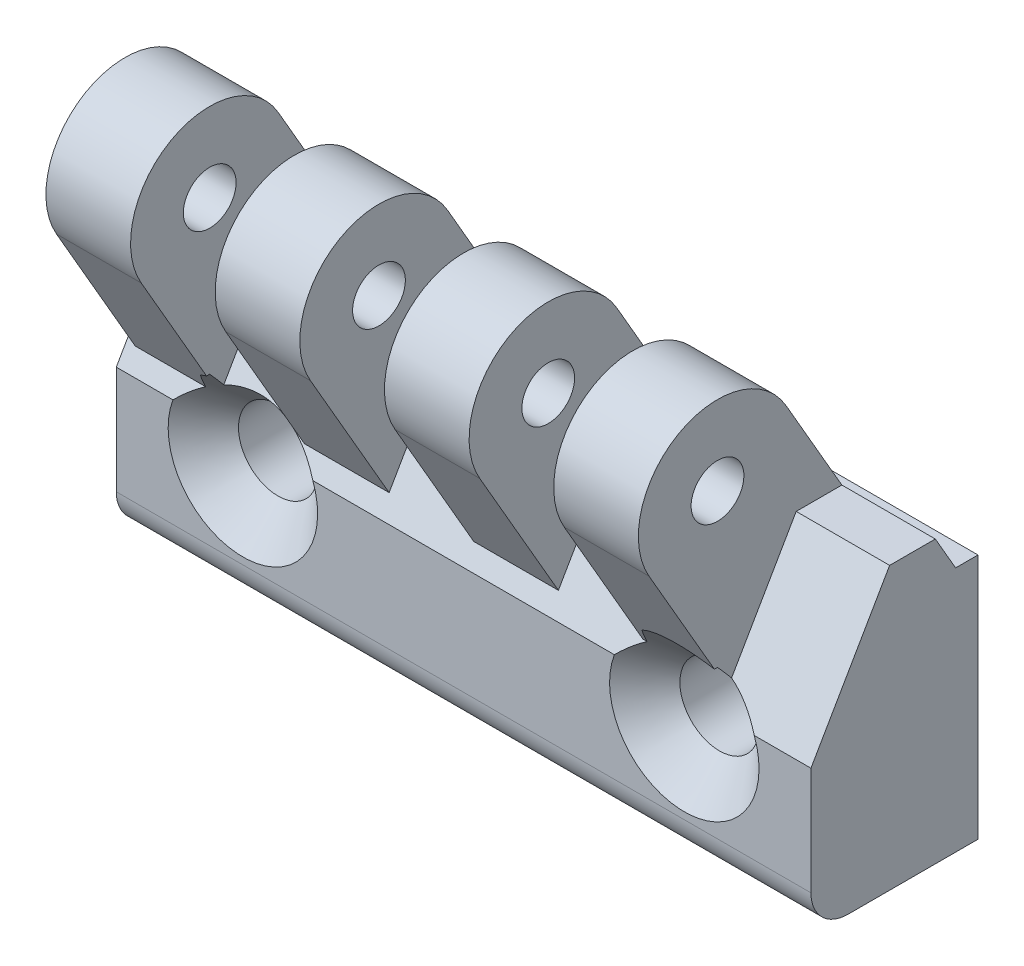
ISO-10303-21;
HEADER;
FILE_DESCRIPTION(('STEP AP214'),'2;1');
FILE_NAME('part.step','',(''),(''),'','','');
FILE_SCHEMA(('AUTOMOTIVE_DESIGN { 1 0 10303 214 1 1 1 1 }'));
ENDSEC;
DATA;
#1=APPLICATION_CONTEXT('core data for automotive mechanical design processes');
#2=APPLICATION_PROTOCOL_DEFINITION('international standard','automotive_design',2000,#1);
#3=PRODUCT_CONTEXT('',#1,'mechanical');
#4=PRODUCT('Part','Part','',(#3));
#5=PRODUCT_RELATED_PRODUCT_CATEGORY('part','',(#4));
#6=PRODUCT_DEFINITION_FORMATION('','',#4);
#7=PRODUCT_DEFINITION_CONTEXT('part definition',#1,'design');
#8=PRODUCT_DEFINITION('design','',#6,#7);
#9=PRODUCT_DEFINITION_SHAPE('','',#8);
#10=(LENGTH_UNIT() NAMED_UNIT(*) SI_UNIT(.MILLI.,.METRE.));
#11=(NAMED_UNIT(*) PLANE_ANGLE_UNIT() SI_UNIT($,.RADIAN.));
#12=(NAMED_UNIT(*) SI_UNIT($,.STERADIAN.) SOLID_ANGLE_UNIT());
#13=UNCERTAINTY_MEASURE_WITH_UNIT(LENGTH_MEASURE(1.E-05),#10,'distance_accuracy_value','');
#14=(GEOMETRIC_REPRESENTATION_CONTEXT(3) GLOBAL_UNCERTAINTY_ASSIGNED_CONTEXT((#13)) GLOBAL_UNIT_ASSIGNED_CONTEXT((#10,
#11,#12)) REPRESENTATION_CONTEXT('',''));
#15=CARTESIAN_POINT('',(0.,0.,0.));
#16=DIRECTION('',(0.,0.,1.));
#17=DIRECTION('',(1.,0.,0.));
#18=AXIS2_PLACEMENT_3D('',#15,#16,#17);
#19=CARTESIAN_POINT('',(32.3,9.25,5.0255354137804));
#20=DIRECTION('',(0.,-0.5,-0.866025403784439));
#21=DIRECTION('',(0.,0.866025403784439,-0.5));
#22=AXIS2_PLACEMENT_3D('',#19,#20,#21);
#23=PLANE('',#22);
#24=CARTESIAN_POINT('',(0.,-4.43060796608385,12.9240381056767));
#25=DIRECTION('',(0.,-0.5,-0.866025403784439));
#26=DIRECTION('',(0.,-0.866025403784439,0.5));
#27=AXIS2_PLACEMENT_3D('',#24,#25,#26);
#28=ELLIPSE('',#27,8.86121593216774,6.26582587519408);
#29=CARTESIAN_POINT('',(3.97649343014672,1.5,9.5));
#30=VERTEX_POINT('',#29);
#31=CARTESIAN_POINT('',(-1.8875,2.88696516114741,8.69923529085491));
#32=VERTEX_POINT('',#31);
#33=EDGE_CURVE('E29',#30,#32,#28,.F.);
#34=ORIENTED_EDGE('',*,*,#33,.F.);
#35=DIRECTION('',(-1.,0.,0.));
#36=VECTOR('',#35,1.);
#37=CARTESIAN_POINT('',(32.3,1.5,9.5));
#38=LINE('',#37,#36);
#39=CARTESIAN_POINT('',(21.1235065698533,1.5,9.5));
#40=VERTEX_POINT('',#39);
#41=EDGE_CURVE('E241',#40,#30,#38,.T.);
#42=ORIENTED_EDGE('',*,*,#41,.F.);
#43=CARTESIAN_POINT('',(25.1,-4.43060796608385,12.9240381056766));
#44=DIRECTION('',(0.,-0.5,-0.866025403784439));
#45=DIRECTION('',(0.,-0.866025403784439,0.5));
#46=AXIS2_PLACEMENT_3D('',#43,#44,#45);
#47=ELLIPSE('',#46,8.86121593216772,6.26582587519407);
#48=CARTESIAN_POINT('',(22.4095806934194,2.5,8.92264973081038));
#49=VERTEX_POINT('',#48);
#50=EDGE_CURVE('E952',#49,#40,#47,.F.);
#51=ORIENTED_EDGE('',*,*,#50,.F.);
#52=DIRECTION('',(1.,0.,0.));
#53=VECTOR('',#52,1.);
#54=CARTESIAN_POINT('',(32.3,2.5,8.92264973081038));
#55=LINE('',#54,#53);
#56=CARTESIAN_POINT('',(22.175,2.5,8.92264973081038));
#57=VERTEX_POINT('',#56);
#58=EDGE_CURVE('E387',#57,#49,#55,.T.);
#59=ORIENTED_EDGE('',*,*,#58,.F.);
#60=DIRECTION('',(0.,-0.866025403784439,0.5));
#61=VECTOR('',#60,1.);
#62=CARTESIAN_POINT('',(22.175,9.25,5.0255354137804));
#63=LINE('',#62,#61);
#64=CARTESIAN_POINT('',(22.175,9.25,5.0255354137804));
#65=VERTEX_POINT('',#64);
#66=EDGE_CURVE('E777',#65,#57,#63,.T.);
#67=ORIENTED_EDGE('',*,*,#66,.F.);
#68=DIRECTION('',(-1.,0.,0.));
#69=VECTOR('',#68,1.);
#70=CARTESIAN_POINT('',(32.3,9.25,5.0255354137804));
#71=LINE('',#70,#69);
#72=CARTESIAN_POINT('',(17.3625,9.25,5.0255354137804));
#73=VERTEX_POINT('',#72);
#74=EDGE_CURVE('E271',#65,#73,#71,.T.);
#75=ORIENTED_EDGE('',*,*,#74,.T.);
#76=DIRECTION('',(0.,-0.866025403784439,0.5));
#77=VECTOR('',#76,1.);
#78=CARTESIAN_POINT('',(17.3625,9.25,5.0255354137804));
#79=LINE('',#78,#77);
#80=CARTESIAN_POINT('',(17.3625,2.5,8.92264973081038));
#81=VERTEX_POINT('',#80);
#82=EDGE_CURVE('E373',#73,#81,#79,.T.);
#83=ORIENTED_EDGE('',*,*,#82,.T.);
#84=DIRECTION('',(1.,0.,0.));
#85=VECTOR('',#84,1.);
#86=CARTESIAN_POINT('',(32.3,2.5,8.92264973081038));
#87=LINE('',#86,#85);
#88=CARTESIAN_POINT('',(12.55,2.5,8.92264973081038));
#89=VERTEX_POINT('',#88);
#90=EDGE_CURVE('E365',#89,#81,#87,.T.);
#91=ORIENTED_EDGE('',*,*,#90,.F.);
#92=DIRECTION('',(0.,-0.866025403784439,0.5));
#93=VECTOR('',#92,1.);
#94=CARTESIAN_POINT('',(12.55,9.25,5.0255354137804));
#95=LINE('',#94,#93);
#96=CARTESIAN_POINT('',(12.55,9.25,5.0255354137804));
#97=VERTEX_POINT('',#96);
#98=EDGE_CURVE('E290',#97,#89,#95,.T.);
#99=ORIENTED_EDGE('',*,*,#98,.F.);
#100=CARTESIAN_POINT('',(7.7375,9.25,5.0255354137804));
#101=VERTEX_POINT('',#100);
#102=EDGE_CURVE('E276',#97,#101,#71,.T.);
#103=ORIENTED_EDGE('',*,*,#102,.T.);
#104=DIRECTION('',(0.,-0.866025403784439,0.5));
#105=VECTOR('',#104,1.);
#106=CARTESIAN_POINT('',(7.7375,9.25,5.0255354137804));
#107=LINE('',#106,#105);
#108=CARTESIAN_POINT('',(7.7375,2.5,8.92264973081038));
#109=VERTEX_POINT('',#108);
#110=EDGE_CURVE('E288',#101,#109,#107,.T.);
#111=ORIENTED_EDGE('',*,*,#110,.T.);
#112=DIRECTION('',(-1.,0.,0.));
#113=VECTOR('',#112,1.);
#114=CARTESIAN_POINT('',(32.3,2.5,8.92264973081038));
#115=LINE('',#114,#113);
#116=CARTESIAN_POINT('',(2.925,2.5,8.92264973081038));
#117=VERTEX_POINT('',#116);
#118=EDGE_CURVE('E376',#109,#117,#115,.T.);
#119=ORIENTED_EDGE('',*,*,#118,.T.);
#120=DIRECTION('',(0.,-0.866025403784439,0.5));
#121=VECTOR('',#120,1.);
#122=CARTESIAN_POINT('',(2.925,9.25,5.0255354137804));
#123=LINE('',#122,#121);
#124=CARTESIAN_POINT('',(2.925,9.25,5.0255354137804));
#125=VERTEX_POINT('',#124);
#126=EDGE_CURVE('E378',#125,#117,#123,.T.);
#127=ORIENTED_EDGE('',*,*,#126,.F.);
#128=CARTESIAN_POINT('',(-1.8875,9.25,5.0255354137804));
#129=VERTEX_POINT('',#128);
#130=EDGE_CURVE('E270',#125,#129,#71,.T.);
#131=ORIENTED_EDGE('',*,*,#130,.T.);
#132=DIRECTION('',(0.,-0.866025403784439,0.5));
#133=VECTOR('',#132,1.);
#134=CARTESIAN_POINT('',(-1.8875,9.25,5.0255354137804));
#135=LINE('',#134,#133);
#136=EDGE_CURVE('E810',#129,#32,#135,.T.);
#137=ORIENTED_EDGE('',*,*,#136,.T.);
#138=EDGE_LOOP('',(#34,#42,#51,#59,#67,#75,#83,#91,#99,#103,#111,#119,#127,#131,#137));
#139=FACE_BOUND('',#138,.T.);
#140=ADVANCED_FACE('F14',(#139),#23,.F.);
#141=CARTESIAN_POINT('',(-1.8875,12.5000000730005,9.50000004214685));
#142=DIRECTION('',(1.,0.,0.));
#143=DIRECTION('',(0.,1.,0.));
#144=AXIS2_PLACEMENT_3D('',#141,#142,#143);
#145=PLANE('',#144);
#146=CARTESIAN_POINT('',(-1.8875,12.5,9.5));
#147=DIRECTION('',(1.,0.,0.));
#148=DIRECTION('',(0.,1.,0.));
#149=AXIS2_PLACEMENT_3D('',#146,#147,#148);
#150=CIRCLE('',#149,1.5);
#151=CARTESIAN_POINT('',(-1.8875,14.,9.5));
#152=VERTEX_POINT('',#151);
#153=EDGE_CURVE('E787',#152,#152,#150,.T.);
#154=ORIENTED_EDGE('',*,*,#153,.F.);
#155=EDGE_LOOP('',(#154));
#156=FACE_BOUND('',#155,.T.);
#157=DIRECTION('',(0.,-0.866025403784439,-0.5));
#158=VECTOR('',#157,1.);
#159=CARTESIAN_POINT('',(-1.8875,10.25,13.39711431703));
#160=LINE('',#159,#158);
#161=CARTESIAN_POINT('',(-1.8875,10.25,13.39711431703));
#162=VERTEX_POINT('',#161);
#163=CARTESIAN_POINT('',(-1.8875,3.80786603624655,9.67774653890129));
#164=VERTEX_POINT('',#163);
#165=EDGE_CURVE('E801',#162,#164,#160,.T.);
#166=ORIENTED_EDGE('',*,*,#165,.T.);
#167=DIRECTION('',(0.,0.,-1.));
#168=VECTOR('',#167,1.);
#169=CARTESIAN_POINT('',(-1.8875,3.80786603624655,0.));
#170=LINE('',#169,#168);
#171=CARTESIAN_POINT('',(-1.8875,3.80786603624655,9.5));
#172=VERTEX_POINT('',#171);
#173=EDGE_CURVE('E9',#164,#172,#170,.T.);
#174=ORIENTED_EDGE('',*,*,#173,.T.);
#175=CARTESIAN_POINT('',(-1.8875,5.35278261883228,10.9258204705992));
#176=CARTESIAN_POINT('',(-1.8875,5.23920519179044,10.8187151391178));
#177=CARTESIAN_POINT('',(-1.8875,5.12544667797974,10.7118009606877));
#178=CARTESIAN_POINT('',(-1.8875,4.8974741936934,10.4984543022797));
#179=CARTESIAN_POINT('',(-1.8875,4.7832602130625,10.3920218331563));
#180=CARTESIAN_POINT('',(-1.8875,4.55423158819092,10.1796899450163));
#181=CARTESIAN_POINT('',(-1.8875,4.43941667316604,10.0737908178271));
#182=CARTESIAN_POINT('',(-1.8875,4.20911882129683,9.86272290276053));
#183=CARTESIAN_POINT('',(-1.8875,4.09363589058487,9.75755410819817));
#184=CARTESIAN_POINT('',(-1.8875,3.86246795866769,9.54870579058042));
#185=CARTESIAN_POINT('',(-1.8875,3.74678746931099,9.44502127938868));
#186=CARTESIAN_POINT('',(-1.8875,3.5143885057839,9.23882265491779));
#187=CARTESIAN_POINT('',(-1.8875,3.3976700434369,9.1363085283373));
#188=CARTESIAN_POINT('',(-1.8875,3.16290027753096,8.93282008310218));
#189=CARTESIAN_POINT('',(-1.8875,3.04484900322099,8.8318457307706));
#190=CARTESIAN_POINT('',(-1.8875,2.80700283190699,8.63197469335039));
#191=CARTESIAN_POINT('',(-1.8875,2.68720802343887,8.53307790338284));
#192=CARTESIAN_POINT('',(-1.8875,2.45986470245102,8.34993914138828));
#193=CARTESIAN_POINT('',(-1.8875,2.35258181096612,8.26536829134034));
#194=CARTESIAN_POINT('',(-1.8875,2.13567374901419,8.09936213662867));
#195=CARTESIAN_POINT('',(-1.8875,2.02604970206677,8.01792537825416));
#196=CARTESIAN_POINT('',(-1.8875,1.85908077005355,7.89902222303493));
#197=CARTESIAN_POINT('',(-1.8875,1.80292868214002,7.85988174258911));
#198=CARTESIAN_POINT('',(-1.8875,1.6896943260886,7.78298131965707));
#199=CARTESIAN_POINT('',(-1.8875,1.63261217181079,7.74522120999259));
#200=CARTESIAN_POINT('',(-1.8875,1.51727904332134,7.67132632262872));
#201=CARTESIAN_POINT('',(-1.8875,1.45902646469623,7.63519403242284));
#202=CARTESIAN_POINT('',(-1.8875,1.34123912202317,7.56503068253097));
#203=CARTESIAN_POINT('',(-1.8875,1.28170382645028,7.5310005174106));
#204=CARTESIAN_POINT('',(-1.8875,1.2214539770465,7.49824510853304));
#205=B_SPLINE_CURVE_WITH_KNOTS('',3,(#175,#176,#177,#178,#179,#180,#181,#182,#183,#184,#185,
#186,#187,#188,#189,#190,#191,#192,#193,#194,#195,#196,#197,#198,#199,#200,#201,#202,#203,#204),
.UNSPECIFIED.,.F.,.F.,(4,2,2,2,2,2,2,2,2,2,2,2,2,2,4),(0.,0.468340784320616,0.936692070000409,
1.40527657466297,1.87385678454,2.33988951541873,2.80591694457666,3.27193416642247,
3.7379278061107,4.14771742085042,4.55731461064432,4.76264044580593,4.96794133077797,
5.17354597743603,5.37923752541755),.UNSPECIFIED.);
#206=EDGE_CURVE('E22',#172,#32,#205,.T.);
#207=ORIENTED_EDGE('',*,*,#206,.T.);
#208=ORIENTED_EDGE('',*,*,#136,.F.);
#209=DIRECTION('',(0.,0.,1.));
#210=VECTOR('',#209,1.);
#211=CARTESIAN_POINT('',(-1.8875,9.25,2.42745920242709));
#212=LINE('',#211,#210);
#213=CARTESIAN_POINT('',(-1.8875,9.25,2.42745920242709));
#214=VERTEX_POINT('',#213);
#215=EDGE_CURVE('E813',#214,#129,#212,.T.);
#216=ORIENTED_EDGE('',*,*,#215,.F.);
#217=DIRECTION('',(0.,0.866025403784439,0.5));
#218=VECTOR('',#217,1.);
#219=CARTESIAN_POINT('',(-1.8875,6.77756813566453,1.));
#220=LINE('',#219,#218);
#221=CARTESIAN_POINT('',(-1.8875,14.75,5.60288568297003));
#222=VERTEX_POINT('',#221);
#223=EDGE_CURVE('E783',#214,#222,#220,.T.);
#224=ORIENTED_EDGE('',*,*,#223,.T.);
#225=CARTESIAN_POINT('',(-1.8875,12.5000000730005,9.50000004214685));
#226=DIRECTION('',(1.,0.,0.));
#227=DIRECTION('',(0.,1.,0.));
#228=AXIS2_PLACEMENT_3D('',#225,#226,#227);
#229=CIRCLE('',#228,4.5);
#230=EDGE_CURVE('E798',#222,#162,#229,.T.);
#231=ORIENTED_EDGE('',*,*,#230,.T.);
#232=EDGE_LOOP('',(#166,#174,#207,#208,#216,#224,#231));
#233=FACE_BOUND('',#232,.T.);
#234=ADVANCED_FACE('F423',(#156,#233),#145,.T.);
#235=CARTESIAN_POINT('',(29.0764934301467,1.5,9.5));
#236=VERTEX_POINT('',#235);
#237=CARTESIAN_POINT('',(26.9875,2.88696516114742,8.69923529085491));
#238=VERTEX_POINT('',#237);
#239=EDGE_CURVE('E37',#236,#238,#47,.F.);
#240=ORIENTED_EDGE('',*,*,#239,.F.);
#241=CARTESIAN_POINT('',(32.3,1.5,9.5));
#242=VERTEX_POINT('',#241);
#243=EDGE_CURVE('E261',#242,#236,#38,.T.);
#244=ORIENTED_EDGE('',*,*,#243,.F.);
#245=DIRECTION('',(0.,-0.866025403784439,0.5));
#246=VECTOR('',#245,1.);
#247=CARTESIAN_POINT('',(32.3,9.25,5.0255354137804));
#248=LINE('',#247,#246);
#249=CARTESIAN_POINT('',(32.3,9.25,5.0255354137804));
#250=VERTEX_POINT('',#249);
#251=EDGE_CURVE('E330',#250,#242,#248,.T.);
#252=ORIENTED_EDGE('',*,*,#251,.F.);
#253=CARTESIAN_POINT('',(26.9875,9.25,5.0255354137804));
#254=VERTEX_POINT('',#253);
#255=EDGE_CURVE('E277',#250,#254,#71,.T.);
#256=ORIENTED_EDGE('',*,*,#255,.T.);
#257=DIRECTION('',(0.,-0.866025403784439,0.5));
#258=VECTOR('',#257,1.);
#259=CARTESIAN_POINT('',(26.9875,9.25,5.0255354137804));
#260=LINE('',#259,#258);
#261=EDGE_CURVE('E780',#254,#238,#260,.T.);
#262=ORIENTED_EDGE('',*,*,#261,.T.);
#263=EDGE_LOOP('',(#240,#244,#252,#256,#262));
#264=FACE_BOUND('',#263,.T.);
#265=ADVANCED_FACE('F425',(#264),#23,.F.);
#266=CARTESIAN_POINT('',(26.9875,12.5000000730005,9.50000004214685));
#267=DIRECTION('',(1.,0.,0.));
#268=DIRECTION('',(0.,1.,0.));
#269=AXIS2_PLACEMENT_3D('',#266,#267,#268);
#270=PLANE('',#269);
#271=CARTESIAN_POINT('',(26.9875,12.5,9.5));
#272=DIRECTION('',(1.,0.,0.));
#273=DIRECTION('',(0.,1.,0.));
#274=AXIS2_PLACEMENT_3D('',#271,#272,#273);
#275=CIRCLE('',#274,1.5);
#276=CARTESIAN_POINT('',(26.9875,14.,9.5));
#277=VERTEX_POINT('',#276);
#278=EDGE_CURVE('E745',#277,#277,#275,.T.);
#279=ORIENTED_EDGE('',*,*,#278,.F.);
#280=EDGE_LOOP('',(#279));
#281=FACE_BOUND('',#280,.T.);
#282=DIRECTION('',(0.,-0.866025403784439,-0.5));
#283=VECTOR('',#282,1.);
#284=CARTESIAN_POINT('',(26.9875,10.25,13.39711431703));
#285=LINE('',#284,#283);
#286=CARTESIAN_POINT('',(26.9875,10.25,13.39711431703));
#287=VERTEX_POINT('',#286);
#288=CARTESIAN_POINT('',(26.9875,3.80786603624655,9.67774653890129));
#289=VERTEX_POINT('',#288);
#290=EDGE_CURVE('E749',#287,#289,#285,.T.);
#291=ORIENTED_EDGE('',*,*,#290,.T.);
#292=DIRECTION('',(0.,0.,-1.));
#293=VECTOR('',#292,1.);
#294=CARTESIAN_POINT('',(26.9875,3.80786603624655,0.));
#295=LINE('',#294,#293);
#296=CARTESIAN_POINT('',(26.9875,3.80786603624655,9.5));
#297=VERTEX_POINT('',#296);
#298=EDGE_CURVE('E398',#289,#297,#295,.T.);
#299=ORIENTED_EDGE('',*,*,#298,.T.);
#300=CARTESIAN_POINT('',(26.9875,5.35278261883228,10.9258204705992));
#301=CARTESIAN_POINT('',(26.9875,5.23920519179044,10.8187151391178));
#302=CARTESIAN_POINT('',(26.9875,5.12544667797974,10.7118009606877));
#303=CARTESIAN_POINT('',(26.9875,4.8974741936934,10.4984543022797));
#304=CARTESIAN_POINT('',(26.9875,4.7832602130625,10.3920218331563));
#305=CARTESIAN_POINT('',(26.9875,4.55423158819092,10.1796899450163));
#306=CARTESIAN_POINT('',(26.9875,4.43941667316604,10.0737908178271));
#307=CARTESIAN_POINT('',(26.9875,4.20911882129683,9.86272290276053));
#308=CARTESIAN_POINT('',(26.9875,4.09363589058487,9.75755410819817));
#309=CARTESIAN_POINT('',(26.9875,3.86246795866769,9.54870579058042));
#310=CARTESIAN_POINT('',(26.9875,3.74678746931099,9.44502127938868));
#311=CARTESIAN_POINT('',(26.9875,3.5143885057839,9.23882265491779));
#312=CARTESIAN_POINT('',(26.9875,3.3976700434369,9.1363085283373));
#313=CARTESIAN_POINT('',(26.9875,3.16290027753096,8.93282008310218));
#314=CARTESIAN_POINT('',(26.9875,3.04484900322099,8.8318457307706));
#315=CARTESIAN_POINT('',(26.9875,2.80700283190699,8.63197469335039));
#316=CARTESIAN_POINT('',(26.9875,2.68720802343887,8.53307790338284));
#317=CARTESIAN_POINT('',(26.9875,2.45986470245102,8.34993914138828));
#318=CARTESIAN_POINT('',(26.9875,2.35258181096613,8.26536829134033));
#319=CARTESIAN_POINT('',(26.9875,2.13567374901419,8.09936213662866));
#320=CARTESIAN_POINT('',(26.9875,2.02604970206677,8.01792537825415));
#321=CARTESIAN_POINT('',(26.9875,1.85908077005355,7.89902222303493));
#322=CARTESIAN_POINT('',(26.9875,1.80292868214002,7.85988174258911));
#323=CARTESIAN_POINT('',(26.9875,1.6896943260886,7.78298131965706));
#324=CARTESIAN_POINT('',(26.9875,1.63261217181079,7.74522120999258));
#325=CARTESIAN_POINT('',(26.9875,1.51727904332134,7.67132632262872));
#326=CARTESIAN_POINT('',(26.9875,1.45902646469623,7.63519403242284));
#327=CARTESIAN_POINT('',(26.9875,1.34123912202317,7.56503068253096));
#328=CARTESIAN_POINT('',(26.9875,1.28170382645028,7.53100051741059));
#329=CARTESIAN_POINT('',(26.9875,1.2214539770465,7.49824510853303));
#330=B_SPLINE_CURVE_WITH_KNOTS('',3,(#300,#301,#302,#303,#304,#305,#306,#307,#308,#309,#310,
#311,#312,#313,#314,#315,#316,#317,#318,#319,#320,#321,#322,#323,#324,#325,#326,#327,#328,#329),
.UNSPECIFIED.,.F.,.F.,(4,2,2,2,2,2,2,2,2,2,2,2,2,2,4),(0.,0.468340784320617,0.936692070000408,
1.40527657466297,1.87385678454,2.33988951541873,2.80591694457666,3.27193416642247,
3.73792780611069,4.14771742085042,4.55731461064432,4.76264044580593,4.96794133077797,
5.17354597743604,5.37923752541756),.UNSPECIFIED.);
#331=EDGE_CURVE('E390',#297,#238,#330,.T.);
#332=ORIENTED_EDGE('',*,*,#331,.T.);
#333=ORIENTED_EDGE('',*,*,#261,.F.);
#334=DIRECTION('',(0.,0.,1.));
#335=VECTOR('',#334,1.);
#336=CARTESIAN_POINT('',(26.9875,9.25,2.42745920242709));
#337=LINE('',#336,#335);
#338=CARTESIAN_POINT('',(26.9875,9.25,2.42745920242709));
#339=VERTEX_POINT('',#338);
#340=EDGE_CURVE('E385',#339,#254,#337,.T.);
#341=ORIENTED_EDGE('',*,*,#340,.F.);
#342=DIRECTION('',(0.,0.866025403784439,0.5));
#343=VECTOR('',#342,1.);
#344=CARTESIAN_POINT('',(26.9875,6.77756813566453,1.));
#345=LINE('',#344,#343);
#346=CARTESIAN_POINT('',(26.9875,14.75,5.60288568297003));
#347=VERTEX_POINT('',#346);
#348=EDGE_CURVE('E758',#339,#347,#345,.T.);
#349=ORIENTED_EDGE('',*,*,#348,.T.);
#350=CARTESIAN_POINT('',(26.9875,12.5000000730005,9.50000004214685));
#351=DIRECTION('',(1.,0.,0.));
#352=DIRECTION('',(0.,1.,0.));
#353=AXIS2_PLACEMENT_3D('',#350,#351,#352);
#354=CIRCLE('',#353,4.5);
#355=EDGE_CURVE('E751',#347,#287,#354,.T.);
#356=ORIENTED_EDGE('',*,*,#355,.T.);
#357=EDGE_LOOP('',(#291,#299,#332,#333,#341,#349,#356));
#358=FACE_BOUND('',#357,.T.);
#359=ADVANCED_FACE('F399',(#281,#358),#270,.T.);
#360=CARTESIAN_POINT('',(32.3,9.25,2.42745920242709));
#361=DIRECTION('',(0.,-1.,0.));
#362=DIRECTION('',(1.,0.,0.));
#363=AXIS2_PLACEMENT_3D('',#360,#361,#362);
#364=PLANE('',#363);
#365=DIRECTION('',(0.,0.,1.));
#366=VECTOR('',#365,1.);
#367=CARTESIAN_POINT('',(22.175,9.25,2.42745920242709));
#368=LINE('',#367,#366);
#369=CARTESIAN_POINT('',(22.175,9.25,2.42745920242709));
#370=VERTEX_POINT('',#369);
#371=EDGE_CURVE('E382',#370,#65,#368,.T.);
#372=ORIENTED_EDGE('',*,*,#371,.F.);
#373=DIRECTION('',(-1.,0.,0.));
#374=VECTOR('',#373,1.);
#375=CARTESIAN_POINT('',(32.3,9.25,2.42745920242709));
#376=LINE('',#375,#374);
#377=CARTESIAN_POINT('',(17.3625,9.25,2.42745920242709));
#378=VERTEX_POINT('',#377);
#379=EDGE_CURVE('E876',#370,#378,#376,.T.);
#380=ORIENTED_EDGE('',*,*,#379,.T.);
#381=DIRECTION('',(0.,0.,1.));
#382=VECTOR('',#381,1.);
#383=CARTESIAN_POINT('',(17.3625,9.25,2.42745920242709));
#384=LINE('',#383,#382);
#385=EDGE_CURVE('E306',#378,#73,#384,.T.);
#386=ORIENTED_EDGE('',*,*,#385,.T.);
#387=ORIENTED_EDGE('',*,*,#74,.F.);
#388=EDGE_LOOP('',(#372,#380,#386,#387));
#389=FACE_BOUND('',#388,.T.);
#390=ADVANCED_FACE('F445',(#389),#364,.F.);
#391=DIRECTION('',(0.,0.,1.));
#392=VECTOR('',#391,1.);
#393=CARTESIAN_POINT('',(-6.7,9.25,2.42745920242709));
#394=LINE('',#393,#392);
#395=CARTESIAN_POINT('',(-6.7,9.25,2.42745920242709));
#396=VERTEX_POINT('',#395);
#397=CARTESIAN_POINT('',(-6.7,9.25,5.0255354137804));
#398=VERTEX_POINT('',#397);
#399=EDGE_CURVE('E819',#396,#398,#394,.T.);
#400=ORIENTED_EDGE('',*,*,#399,.F.);
#401=CARTESIAN_POINT('',(-7.2,9.25,2.42745920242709));
#402=VERTEX_POINT('',#401);
#403=EDGE_CURVE('E283',#396,#402,#376,.T.);
#404=ORIENTED_EDGE('',*,*,#403,.T.);
#405=DIRECTION('',(0.,0.,1.));
#406=VECTOR('',#405,1.);
#407=CARTESIAN_POINT('',(-7.2,9.25,2.42745920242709));
#408=LINE('',#407,#406);
#409=CARTESIAN_POINT('',(-7.2,9.25,5.0255354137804));
#410=VERTEX_POINT('',#409);
#411=EDGE_CURVE('E345',#402,#410,#408,.T.);
#412=ORIENTED_EDGE('',*,*,#411,.T.);
#413=EDGE_CURVE('E267',#398,#410,#71,.T.);
#414=ORIENTED_EDGE('',*,*,#413,.F.);
#415=EDGE_LOOP('',(#400,#404,#412,#414));
#416=FACE_BOUND('',#415,.T.);
#417=ADVANCED_FACE('F438',(#416),#364,.F.);
#418=CARTESIAN_POINT('',(-2.6904193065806,2.5,8.92264973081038));
#419=VERTEX_POINT('',#418);
#420=CARTESIAN_POINT('',(-3.9764934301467,1.5,9.5));
#421=VERTEX_POINT('',#420);
#422=EDGE_CURVE('E246',#419,#421,#28,.F.);
#423=ORIENTED_EDGE('',*,*,#422,.F.);
#424=DIRECTION('',(-1.,0.,0.));
#425=VECTOR('',#424,1.);
#426=CARTESIAN_POINT('',(32.3,2.5,8.92264973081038));
#427=LINE('',#426,#425);
#428=CARTESIAN_POINT('',(-6.7,2.5,8.92264973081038));
#429=VERTEX_POINT('',#428);
#430=EDGE_CURVE('E380',#419,#429,#427,.T.);
#431=ORIENTED_EDGE('',*,*,#430,.T.);
#432=DIRECTION('',(0.,-0.866025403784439,0.5));
#433=VECTOR('',#432,1.);
#434=CARTESIAN_POINT('',(-6.7,9.25,5.0255354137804));
#435=LINE('',#434,#433);
#436=EDGE_CURVE('E816',#398,#429,#435,.T.);
#437=ORIENTED_EDGE('',*,*,#436,.F.);
#438=ORIENTED_EDGE('',*,*,#413,.T.);
#439=DIRECTION('',(0.,-0.866025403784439,0.5));
#440=VECTOR('',#439,1.);
#441=CARTESIAN_POINT('',(-7.2,9.25,5.0255354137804));
#442=LINE('',#441,#440);
#443=CARTESIAN_POINT('',(-7.2,1.5,9.5));
#444=VERTEX_POINT('',#443);
#445=EDGE_CURVE('E257',#410,#444,#442,.T.);
#446=ORIENTED_EDGE('',*,*,#445,.T.);
#447=EDGE_CURVE('E238',#421,#444,#38,.T.);
#448=ORIENTED_EDGE('',*,*,#447,.F.);
#449=EDGE_LOOP('',(#423,#431,#437,#438,#446,#448));
#450=FACE_BOUND('',#449,.T.);
#451=ADVANCED_FACE('F255',(#450),#23,.F.);
#452=CARTESIAN_POINT('',(2.925,9.25,2.42745920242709));
#453=VERTEX_POINT('',#452);
#454=EDGE_CURVE('E877',#453,#214,#376,.T.);
#455=ORIENTED_EDGE('',*,*,#454,.T.);
#456=ORIENTED_EDGE('',*,*,#215,.T.);
#457=ORIENTED_EDGE('',*,*,#130,.F.);
#458=DIRECTION('',(0.,0.,1.));
#459=VECTOR('',#458,1.);
#460=CARTESIAN_POINT('',(2.925,9.25,2.42745920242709));
#461=LINE('',#460,#459);
#462=EDGE_CURVE('E848',#453,#125,#461,.T.);
#463=ORIENTED_EDGE('',*,*,#462,.F.);
#464=EDGE_LOOP('',(#455,#456,#457,#463));
#465=FACE_BOUND('',#464,.T.);
#466=ADVANCED_FACE('F437',(#465),#364,.F.);
#467=CARTESIAN_POINT('',(12.55,9.25,2.42745920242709));
#468=VERTEX_POINT('',#467);
#469=CARTESIAN_POINT('',(7.7375,9.25,2.42745920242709));
#470=VERTEX_POINT('',#469);
#471=EDGE_CURVE('E875',#468,#470,#376,.T.);
#472=ORIENTED_EDGE('',*,*,#471,.T.);
#473=DIRECTION('',(0.,0.,1.));
#474=VECTOR('',#473,1.);
#475=CARTESIAN_POINT('',(7.7375,9.25,2.42745920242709));
#476=LINE('',#475,#474);
#477=EDGE_CURVE('E298',#470,#101,#476,.T.);
#478=ORIENTED_EDGE('',*,*,#477,.T.);
#479=ORIENTED_EDGE('',*,*,#102,.F.);
#480=DIRECTION('',(0.,0.,1.));
#481=VECTOR('',#480,1.);
#482=CARTESIAN_POINT('',(12.55,9.25,2.42745920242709));
#483=LINE('',#482,#481);
#484=EDGE_CURVE('E296',#468,#97,#483,.T.);
#485=ORIENTED_EDGE('',*,*,#484,.F.);
#486=EDGE_LOOP('',(#472,#478,#479,#485));
#487=FACE_BOUND('',#486,.T.);
#488=ADVANCED_FACE('F295',(#487),#364,.F.);
#489=CARTESIAN_POINT('',(32.3,-4.6388888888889,7.38888888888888));
#490=DIRECTION('',(-1.,0.,0.));
#491=DIRECTION('',(0.,-1.,0.));
#492=AXIS2_PLACEMENT_3D('',#489,#490,#491);
#493=CYLINDRICAL_SURFACE('',#492,2.11111111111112);
#494=CARTESIAN_POINT('',(-7.2,-4.6388888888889,7.38888888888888));
#495=DIRECTION('',(1.,0.,0.));
#496=DIRECTION('',(0.,1.,0.));
#497=AXIS2_PLACEMENT_3D('',#494,#495,#496);
#498=CIRCLE('',#497,2.11111111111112);
#499=CARTESIAN_POINT('',(-7.2,-4.6388888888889,9.5));
#500=VERTEX_POINT('',#499);
#501=CARTESIAN_POINT('',(-7.2,-6.75,7.38888888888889));
#502=VERTEX_POINT('',#501);
#503=EDGE_CURVE('E309',#500,#502,#498,.T.);
#504=ORIENTED_EDGE('',*,*,#503,.T.);
#505=DIRECTION('',(-1.,0.,0.));
#506=VECTOR('',#505,1.);
#507=CARTESIAN_POINT('',(32.3,-6.75,7.38888888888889));
#508=LINE('',#507,#506);
#509=CARTESIAN_POINT('',(32.3,-6.75,7.38888888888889));
#510=VERTEX_POINT('',#509);
#511=EDGE_CURVE('E361',#510,#502,#508,.T.);
#512=ORIENTED_EDGE('',*,*,#511,.F.);
#513=CARTESIAN_POINT('',(32.3,-4.6388888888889,7.38888888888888));
#514=DIRECTION('',(1.,0.,0.));
#515=DIRECTION('',(0.,1.,0.));
#516=AXIS2_PLACEMENT_3D('',#513,#514,#515);
#517=CIRCLE('',#516,2.11111111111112);
#518=CARTESIAN_POINT('',(32.3,-4.6388888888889,9.5));
#519=VERTEX_POINT('',#518);
#520=EDGE_CURVE('E316',#519,#510,#517,.T.);
#521=ORIENTED_EDGE('',*,*,#520,.F.);
#522=DIRECTION('',(-1.,0.,0.));
#523=VECTOR('',#522,1.);
#524=CARTESIAN_POINT('',(32.3,-4.6388888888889,9.5));
#525=LINE('',#524,#523);
#526=EDGE_CURVE('E259',#519,#500,#525,.T.);
#527=ORIENTED_EDGE('',*,*,#526,.T.);
#528=EDGE_LOOP('',(#504,#512,#521,#527));
#529=FACE_BOUND('',#528,.T.);
#530=ADVANCED_FACE('F16',(#529),#493,.T.);
#531=CARTESIAN_POINT('',(32.3,-6.75,7.38888888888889));
#532=DIRECTION('',(0.,1.,0.));
#533=DIRECTION('',(-1.,0.,0.));
#534=AXIS2_PLACEMENT_3D('',#531,#532,#533);
#535=PLANE('',#534);
#536=DIRECTION('',(0.,0.,-1.));
#537=VECTOR('',#536,1.);
#538=CARTESIAN_POINT('',(-7.2,-6.75,7.38888888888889));
#539=LINE('',#538,#537);
#540=CARTESIAN_POINT('',(-7.2,-6.75,0.));
#541=VERTEX_POINT('',#540);
#542=EDGE_CURVE('E335',#502,#541,#539,.T.);
#543=ORIENTED_EDGE('',*,*,#542,.T.);
#544=DIRECTION('',(-1.,0.,0.));
#545=VECTOR('',#544,1.);
#546=CARTESIAN_POINT('',(32.3,-6.75,0.));
#547=LINE('',#546,#545);
#548=CARTESIAN_POINT('',(32.3,-6.75,0.));
#549=VERTEX_POINT('',#548);
#550=EDGE_CURVE('E363',#549,#541,#547,.T.);
#551=ORIENTED_EDGE('',*,*,#550,.F.);
#552=DIRECTION('',(0.,0.,-1.));
#553=VECTOR('',#552,1.);
#554=CARTESIAN_POINT('',(32.3,-6.75,7.38888888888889));
#555=LINE('',#554,#553);
#556=EDGE_CURVE('E319',#510,#549,#555,.T.);
#557=ORIENTED_EDGE('',*,*,#556,.F.);
#558=ORIENTED_EDGE('',*,*,#511,.T.);
#559=EDGE_LOOP('',(#543,#551,#557,#558));
#560=FACE_BOUND('',#559,.T.);
#561=ADVANCED_FACE('F362',(#560),#535,.F.);
#562=CARTESIAN_POINT('',(32.3,-6.75,0.));
#563=DIRECTION('',(0.,0.,1.));
#564=DIRECTION('',(1.,0.,0.));
#565=AXIS2_PLACEMENT_3D('',#562,#563,#564);
#566=PLANE('',#565);
#567=CARTESIAN_POINT('',(0.,0.,0.));
#568=DIRECTION('',(0.,0.,-1.));
#569=DIRECTION('',(-1.,0.,0.));
#570=AXIS2_PLACEMENT_3D('',#567,#568,#569);
#571=CIRCLE('',#570,2.25);
#572=CARTESIAN_POINT('',(-2.25,0.,0.));
#573=VERTEX_POINT('',#572);
#574=EDGE_CURVE('E1004',#573,#573,#571,.T.);
#575=ORIENTED_EDGE('',*,*,#574,.F.);
#576=EDGE_LOOP('',(#575));
#577=FACE_BOUND('',#576,.T.);
#578=CARTESIAN_POINT('',(25.1,0.,0.));
#579=DIRECTION('',(0.,0.,-1.));
#580=DIRECTION('',(-1.,0.,0.));
#581=AXIS2_PLACEMENT_3D('',#578,#579,#580);
#582=CIRCLE('',#581,2.25);
#583=CARTESIAN_POINT('',(22.85,0.,0.));
#584=VERTEX_POINT('',#583);
#585=EDGE_CURVE('E941',#584,#584,#582,.T.);
#586=ORIENTED_EDGE('',*,*,#585,.F.);
#587=EDGE_LOOP('',(#586));
#588=FACE_BOUND('',#587,.T.);
#589=DIRECTION('',(0.,1.,0.));
#590=VECTOR('',#589,1.);
#591=CARTESIAN_POINT('',(-7.2,-6.75,0.));
#592=LINE('',#591,#590);
#593=CARTESIAN_POINT('',(-7.2,7.25,0.));
#594=VERTEX_POINT('',#593);
#595=EDGE_CURVE('E337',#541,#594,#592,.T.);
#596=ORIENTED_EDGE('',*,*,#595,.T.);
#597=DIRECTION('',(-1.,0.,0.));
#598=VECTOR('',#597,1.);
#599=CARTESIAN_POINT('',(32.3,7.25,0.));
#600=LINE('',#599,#598);
#601=CARTESIAN_POINT('',(32.3,7.25,0.));
#602=VERTEX_POINT('',#601);
#603=EDGE_CURVE('E367',#602,#594,#600,.T.);
#604=ORIENTED_EDGE('',*,*,#603,.F.);
#605=DIRECTION('',(0.,1.,0.));
#606=VECTOR('',#605,1.);
#607=CARTESIAN_POINT('',(32.3,-6.75,0.));
#608=LINE('',#607,#606);
#609=EDGE_CURVE('E322',#549,#602,#608,.T.);
#610=ORIENTED_EDGE('',*,*,#609,.F.);
#611=ORIENTED_EDGE('',*,*,#550,.T.);
#612=EDGE_LOOP('',(#596,#604,#610,#611));
#613=FACE_BOUND('',#612,.T.);
#614=ADVANCED_FACE('F464',(#577,#588,#613),#566,.F.);
#615=CARTESIAN_POINT('',(32.3,7.25,0.));
#616=DIRECTION('',(0.,-1.,0.));
#617=DIRECTION('',(1.,0.,0.));
#618=AXIS2_PLACEMENT_3D('',#615,#616,#617);
#619=PLANE('',#618);
#620=DIRECTION('',(0.,0.,1.));
#621=VECTOR('',#620,1.);
#622=CARTESIAN_POINT('',(-7.2,7.25,0.));
#623=LINE('',#622,#621);
#624=CARTESIAN_POINT('',(-7.2,7.25,1.27275866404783));
#625=VERTEX_POINT('',#624);
#626=EDGE_CURVE('E339',#594,#625,#623,.T.);
#627=ORIENTED_EDGE('',*,*,#626,.T.);
#628=DIRECTION('',(-1.,0.,0.));
#629=VECTOR('',#628,1.);
#630=CARTESIAN_POINT('',(32.3,7.25,1.27275866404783));
#631=LINE('',#630,#629);
#632=CARTESIAN_POINT('',(32.3,7.25,1.27275866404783));
#633=VERTEX_POINT('',#632);
#634=EDGE_CURVE('E881',#633,#625,#631,.T.);
#635=ORIENTED_EDGE('',*,*,#634,.F.);
#636=DIRECTION('',(0.,0.,1.));
#637=VECTOR('',#636,1.);
#638=CARTESIAN_POINT('',(32.3,7.25,0.));
#639=LINE('',#638,#637);
#640=EDGE_CURVE('E324',#602,#633,#639,.T.);
#641=ORIENTED_EDGE('',*,*,#640,.F.);
#642=ORIENTED_EDGE('',*,*,#603,.T.);
#643=EDGE_LOOP('',(#627,#635,#641,#642));
#644=FACE_BOUND('',#643,.T.);
#645=ADVANCED_FACE('F460',(#644),#619,.F.);
#646=CARTESIAN_POINT('',(32.3,7.25,1.27275866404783));
#647=DIRECTION('',(0.,-0.5,0.866025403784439));
#648=DIRECTION('',(0.,-0.866025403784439,-0.5));
#649=AXIS2_PLACEMENT_3D('',#646,#647,#648);
#650=PLANE('',#649);
#651=ORIENTED_EDGE('',*,*,#634,.T.);
#652=DIRECTION('',(0.,0.866025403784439,0.5));
#653=VECTOR('',#652,1.);
#654=CARTESIAN_POINT('',(-7.2,7.25,1.27275866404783));
#655=LINE('',#654,#653);
#656=EDGE_CURVE('E342',#625,#402,#655,.T.);
#657=ORIENTED_EDGE('',*,*,#656,.T.);
#658=ORIENTED_EDGE('',*,*,#403,.F.);
#659=DIRECTION('',(0.,0.866025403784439,0.5));
#660=VECTOR('',#659,1.);
#661=CARTESIAN_POINT('',(-6.7,6.77756813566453,1.));
#662=LINE('',#661,#660);
#663=CARTESIAN_POINT('',(-6.7,14.75,5.60288568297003));
#664=VERTEX_POINT('',#663);
#665=EDGE_CURVE('E784',#396,#664,#662,.T.);
#666=ORIENTED_EDGE('',*,*,#665,.T.);
#667=DIRECTION('',(1.,0.,0.));
#668=VECTOR('',#667,1.);
#669=CARTESIAN_POINT('',(-6.7,14.75,5.60288568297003));
#670=LINE('',#669,#668);
#671=EDGE_CURVE('E807',#664,#222,#670,.T.);
#672=ORIENTED_EDGE('',*,*,#671,.T.);
#673=ORIENTED_EDGE('',*,*,#223,.F.);
#674=ORIENTED_EDGE('',*,*,#454,.F.);
#675=DIRECTION('',(0.,0.866025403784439,0.5));
#676=VECTOR('',#675,1.);
#677=CARTESIAN_POINT('',(2.925,6.77756813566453,1.));
#678=LINE('',#677,#676);
#679=CARTESIAN_POINT('',(2.925,14.75,5.60288568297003));
#680=VERTEX_POINT('',#679);
#681=EDGE_CURVE('E822',#453,#680,#678,.T.);
#682=ORIENTED_EDGE('',*,*,#681,.T.);
#683=DIRECTION('',(1.,0.,0.));
#684=VECTOR('',#683,1.);
#685=CARTESIAN_POINT('',(2.925,14.75,5.60288568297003));
#686=LINE('',#685,#684);
#687=CARTESIAN_POINT('',(7.7375,14.75,5.60288568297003));
#688=VERTEX_POINT('',#687);
#689=EDGE_CURVE('E844',#680,#688,#686,.T.);
#690=ORIENTED_EDGE('',*,*,#689,.T.);
#691=DIRECTION('',(0.,0.866025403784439,0.5));
#692=VECTOR('',#691,1.);
#693=CARTESIAN_POINT('',(7.7375,6.77756813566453,1.));
#694=LINE('',#693,#692);
#695=EDGE_CURVE('E821',#470,#688,#694,.T.);
#696=ORIENTED_EDGE('',*,*,#695,.F.);
#697=ORIENTED_EDGE('',*,*,#471,.F.);
#698=DIRECTION('',(0.,0.866025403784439,0.5));
#699=VECTOR('',#698,1.);
#700=CARTESIAN_POINT('',(12.55,6.77756813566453,1.));
#701=LINE('',#700,#699);
#702=CARTESIAN_POINT('',(12.55,14.75,5.60288568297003));
#703=VERTEX_POINT('',#702);
#704=EDGE_CURVE('E305',#468,#703,#701,.T.);
#705=ORIENTED_EDGE('',*,*,#704,.T.);
#706=DIRECTION('',(-1.,0.,0.));
#707=VECTOR('',#706,1.);
#708=CARTESIAN_POINT('',(17.3625,14.75,5.60288568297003));
#709=LINE('',#708,#707);
#710=CARTESIAN_POINT('',(17.3625,14.75,5.60288568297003));
#711=VERTEX_POINT('',#710);
#712=EDGE_CURVE('E307',#711,#703,#709,.T.);
#713=ORIENTED_EDGE('',*,*,#712,.F.);
#714=DIRECTION('',(0.,0.866025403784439,0.5));
#715=VECTOR('',#714,1.);
#716=CARTESIAN_POINT('',(17.3625,6.77756813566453,1.));
#717=LINE('',#716,#715);
#718=EDGE_CURVE('E850',#378,#711,#717,.T.);
#719=ORIENTED_EDGE('',*,*,#718,.F.);
#720=ORIENTED_EDGE('',*,*,#379,.F.);
#721=DIRECTION('',(0.,0.866025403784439,0.5));
#722=VECTOR('',#721,1.);
#723=CARTESIAN_POINT('',(22.175,6.77756813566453,1.));
#724=LINE('',#723,#722);
#725=CARTESIAN_POINT('',(22.175,14.75,5.60288568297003));
#726=VERTEX_POINT('',#725);
#727=EDGE_CURVE('E762',#370,#726,#724,.T.);
#728=ORIENTED_EDGE('',*,*,#727,.T.);
#729=DIRECTION('',(-1.,0.,0.));
#730=VECTOR('',#729,1.);
#731=CARTESIAN_POINT('',(26.9875,14.75,5.60288568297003));
#732=LINE('',#731,#730);
#733=EDGE_CURVE('E774',#347,#726,#732,.T.);
#734=ORIENTED_EDGE('',*,*,#733,.F.);
#735=ORIENTED_EDGE('',*,*,#348,.F.);
#736=CARTESIAN_POINT('',(32.3,9.25,2.42745920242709));
#737=VERTEX_POINT('',#736);
#738=EDGE_CURVE('E878',#737,#339,#376,.T.);
#739=ORIENTED_EDGE('',*,*,#738,.F.);
#740=DIRECTION('',(0.,0.866025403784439,0.5));
#741=VECTOR('',#740,1.);
#742=CARTESIAN_POINT('',(32.3,7.25,1.27275866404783));
#743=LINE('',#742,#741);
#744=EDGE_CURVE('E326',#633,#737,#743,.T.);
#745=ORIENTED_EDGE('',*,*,#744,.F.);
#746=EDGE_LOOP('',(#651,#657,#658,#666,#672,#673,#674,#682,#690,#696,#697,#705,#713,#719,#720,
#728,#734,#735,#739,#745));
#747=FACE_BOUND('',#746,.T.);
#748=ADVANCED_FACE('F456',(#747),#650,.F.);
#749=ORIENTED_EDGE('',*,*,#738,.T.);
#750=ORIENTED_EDGE('',*,*,#340,.T.);
#751=ORIENTED_EDGE('',*,*,#255,.F.);
#752=DIRECTION('',(0.,0.,1.));
#753=VECTOR('',#752,1.);
#754=CARTESIAN_POINT('',(32.3,9.25,2.42745920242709));
#755=LINE('',#754,#753);
#756=EDGE_CURVE('E328',#737,#250,#755,.T.);
#757=ORIENTED_EDGE('',*,*,#756,.F.);
#758=EDGE_LOOP('',(#749,#750,#751,#757));
#759=FACE_BOUND('',#758,.T.);
#760=ADVANCED_FACE('F452',(#759),#364,.F.);
#761=CARTESIAN_POINT('',(32.3,1.5,9.5));
#762=DIRECTION('',(0.,0.,-1.));
#763=DIRECTION('',(-1.,0.,0.));
#764=AXIS2_PLACEMENT_3D('',#761,#762,#763);
#765=PLANE('',#764);
#766=CARTESIAN_POINT('',(0.,0.,9.5));
#767=DIRECTION('',(0.,0.,-1.));
#768=DIRECTION('',(-1.,0.,0.));
#769=AXIS2_PLACEMENT_3D('',#766,#767,#768);
#770=CIRCLE('',#769,4.25);
#771=EDGE_CURVE('E234',#30,#421,#770,.T.);
#772=ORIENTED_EDGE('',*,*,#771,.T.);
#773=ORIENTED_EDGE('',*,*,#447,.T.);
#774=DIRECTION('',(0.,-1.,0.));
#775=VECTOR('',#774,1.);
#776=CARTESIAN_POINT('',(-7.2,1.5,9.5));
#777=LINE('',#776,#775);
#778=EDGE_CURVE('E320',#444,#500,#777,.T.);
#779=ORIENTED_EDGE('',*,*,#778,.T.);
#780=ORIENTED_EDGE('',*,*,#526,.F.);
#781=DIRECTION('',(0.,-1.,0.));
#782=VECTOR('',#781,1.);
#783=CARTESIAN_POINT('',(32.3,1.5,9.5));
#784=LINE('',#783,#782);
#785=EDGE_CURVE('E263',#242,#519,#784,.T.);
#786=ORIENTED_EDGE('',*,*,#785,.F.);
#787=ORIENTED_EDGE('',*,*,#243,.T.);
#788=CARTESIAN_POINT('',(25.1,0.,9.5));
#789=DIRECTION('',(0.,0.,-1.));
#790=DIRECTION('',(-1.,0.,0.));
#791=AXIS2_PLACEMENT_3D('',#788,#789,#790);
#792=CIRCLE('',#791,4.25);
#793=EDGE_CURVE('E947',#236,#40,#792,.T.);
#794=ORIENTED_EDGE('',*,*,#793,.T.);
#795=ORIENTED_EDGE('',*,*,#41,.T.);
#796=EDGE_LOOP('',(#772,#773,#779,#780,#786,#787,#794,#795));
#797=FACE_BOUND('',#796,.T.);
#798=ADVANCED_FACE('F236',(#797),#765,.F.);
#799=CARTESIAN_POINT('',(32.3,-4.6388888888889,7.38888888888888));
#800=DIRECTION('',(1.,0.,0.));
#801=DIRECTION('',(0.,1.,0.));
#802=AXIS2_PLACEMENT_3D('',#799,#800,#801);
#803=PLANE('',#802);
#804=ORIENTED_EDGE('',*,*,#520,.T.);
#805=ORIENTED_EDGE('',*,*,#556,.T.);
#806=ORIENTED_EDGE('',*,*,#609,.T.);
#807=ORIENTED_EDGE('',*,*,#640,.T.);
#808=ORIENTED_EDGE('',*,*,#744,.T.);
#809=ORIENTED_EDGE('',*,*,#756,.T.);
#810=ORIENTED_EDGE('',*,*,#251,.T.);
#811=ORIENTED_EDGE('',*,*,#785,.T.);
#812=EDGE_LOOP('',(#804,#805,#806,#807,#808,#809,#810,#811));
#813=FACE_BOUND('',#812,.T.);
#814=ADVANCED_FACE('F547',(#813),#803,.T.);
#815=CARTESIAN_POINT('',(-7.2,-4.6388888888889,7.38888888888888));
#816=DIRECTION('',(1.,0.,0.));
#817=DIRECTION('',(0.,1.,0.));
#818=AXIS2_PLACEMENT_3D('',#815,#816,#817);
#819=PLANE('',#818);
#820=ORIENTED_EDGE('',*,*,#503,.F.);
#821=ORIENTED_EDGE('',*,*,#778,.F.);
#822=ORIENTED_EDGE('',*,*,#445,.F.);
#823=ORIENTED_EDGE('',*,*,#411,.F.);
#824=ORIENTED_EDGE('',*,*,#656,.F.);
#825=ORIENTED_EDGE('',*,*,#626,.F.);
#826=ORIENTED_EDGE('',*,*,#595,.F.);
#827=ORIENTED_EDGE('',*,*,#542,.F.);
#828=EDGE_LOOP('',(#820,#821,#822,#823,#824,#825,#826,#827));
#829=FACE_BOUND('',#828,.T.);
#830=ADVANCED_FACE('F354',(#829),#819,.F.);
#831=CARTESIAN_POINT('',(17.3625,10.25,13.39711431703));
#832=DIRECTION('',(0.,0.5,-0.866025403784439));
#833=DIRECTION('',(0.,0.866025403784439,0.5));
#834=AXIS2_PLACEMENT_3D('',#831,#832,#833);
#835=PLANE('',#834);
#836=DIRECTION('',(0.,-0.866025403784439,-0.5));
#837=VECTOR('',#836,1.);
#838=CARTESIAN_POINT('',(12.55,10.25,13.39711431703));
#839=LINE('',#838,#837);
#840=CARTESIAN_POINT('',(12.55,10.25,13.39711431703));
#841=VERTEX_POINT('',#840);
#842=EDGE_CURVE('E864',#841,#89,#839,.T.);
#843=ORIENTED_EDGE('',*,*,#842,.T.);
#844=ORIENTED_EDGE('',*,*,#90,.T.);
#845=DIRECTION('',(0.,-0.866025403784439,-0.5));
#846=VECTOR('',#845,1.);
#847=CARTESIAN_POINT('',(17.3625,10.25,13.39711431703));
#848=LINE('',#847,#846);
#849=CARTESIAN_POINT('',(17.3625,10.25,13.39711431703));
#850=VERTEX_POINT('',#849);
#851=EDGE_CURVE('E855',#850,#81,#848,.T.);
#852=ORIENTED_EDGE('',*,*,#851,.F.);
#853=DIRECTION('',(-1.,0.,0.));
#854=VECTOR('',#853,1.);
#855=CARTESIAN_POINT('',(17.3625,10.25,13.39711431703));
#856=LINE('',#855,#854);
#857=EDGE_CURVE('E312',#850,#841,#856,.T.);
#858=ORIENTED_EDGE('',*,*,#857,.T.);
#859=EDGE_LOOP('',(#843,#844,#852,#858));
#860=FACE_BOUND('',#859,.T.);
#861=ADVANCED_FACE('F563',(#860),#835,.F.);
#862=CARTESIAN_POINT('',(17.3625,12.5000000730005,9.50000004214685));
#863=DIRECTION('',(1.,0.,0.));
#864=DIRECTION('',(0.,1.,0.));
#865=AXIS2_PLACEMENT_3D('',#862,#863,#864);
#866=PLANE('',#865);
#867=CARTESIAN_POINT('',(17.3625,12.5,9.5));
#868=DIRECTION('',(1.,0.,0.));
#869=DIRECTION('',(0.,1.,0.));
#870=AXIS2_PLACEMENT_3D('',#867,#868,#869);
#871=CIRCLE('',#870,1.5);
#872=CARTESIAN_POINT('',(17.3625,14.,9.5));
#873=VERTEX_POINT('',#872);
#874=EDGE_CURVE('E858',#873,#873,#871,.T.);
#875=ORIENTED_EDGE('',*,*,#874,.F.);
#876=EDGE_LOOP('',(#875));
#877=FACE_BOUND('',#876,.T.);
#878=ORIENTED_EDGE('',*,*,#385,.F.);
#879=ORIENTED_EDGE('',*,*,#718,.T.);
#880=CARTESIAN_POINT('',(17.3625,12.5000000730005,9.50000004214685));
#881=DIRECTION('',(1.,0.,0.));
#882=DIRECTION('',(0.,1.,0.));
#883=AXIS2_PLACEMENT_3D('',#880,#881,#882);
#884=CIRCLE('',#883,4.5);
#885=EDGE_CURVE('E852',#711,#850,#884,.T.);
#886=ORIENTED_EDGE('',*,*,#885,.T.);
#887=ORIENTED_EDGE('',*,*,#851,.T.);
#888=ORIENTED_EDGE('',*,*,#82,.F.);
#889=EDGE_LOOP('',(#878,#879,#886,#887,#888));
#890=FACE_BOUND('',#889,.T.);
#891=ADVANCED_FACE('F571',(#877,#890),#866,.T.);
#892=CARTESIAN_POINT('',(12.55,12.5000000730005,9.50000004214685));
#893=DIRECTION('',(1.,0.,0.));
#894=DIRECTION('',(0.,1.,0.));
#895=AXIS2_PLACEMENT_3D('',#892,#893,#894);
#896=PLANE('',#895);
#897=CARTESIAN_POINT('',(12.55,12.5,9.5));
#898=DIRECTION('',(1.,0.,0.));
#899=DIRECTION('',(0.,1.,0.));
#900=AXIS2_PLACEMENT_3D('',#897,#898,#899);
#901=CIRCLE('',#900,1.5);
#902=CARTESIAN_POINT('',(12.55,14.,9.5));
#903=VERTEX_POINT('',#902);
#904=EDGE_CURVE('E853',#903,#903,#901,.T.);
#905=ORIENTED_EDGE('',*,*,#904,.T.);
#906=EDGE_LOOP('',(#905));
#907=FACE_BOUND('',#906,.T.);
#908=ORIENTED_EDGE('',*,*,#704,.F.);
#909=ORIENTED_EDGE('',*,*,#484,.T.);
#910=ORIENTED_EDGE('',*,*,#98,.T.);
#911=ORIENTED_EDGE('',*,*,#842,.F.);
#912=CARTESIAN_POINT('',(12.55,12.5000000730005,9.50000004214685));
#913=DIRECTION('',(1.,0.,0.));
#914=DIRECTION('',(0.,1.,0.));
#915=AXIS2_PLACEMENT_3D('',#912,#913,#914);
#916=CIRCLE('',#915,4.5);
#917=EDGE_CURVE('E862',#703,#841,#916,.T.);
#918=ORIENTED_EDGE('',*,*,#917,.F.);
#919=EDGE_LOOP('',(#908,#909,#910,#911,#918));
#920=FACE_BOUND('',#919,.T.);
#921=ADVANCED_FACE('F301',(#907,#920),#896,.F.);
#922=CARTESIAN_POINT('',(17.3625,12.5000000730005,9.50000004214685));
#923=DIRECTION('',(-1.,0.,0.));
#924=DIRECTION('',(0.,-1.,0.));
#925=AXIS2_PLACEMENT_3D('',#922,#923,#924);
#926=CYLINDRICAL_SURFACE('',#925,4.5);
#927=ORIENTED_EDGE('',*,*,#917,.T.);
#928=ORIENTED_EDGE('',*,*,#857,.F.);
#929=ORIENTED_EDGE('',*,*,#885,.F.);
#930=ORIENTED_EDGE('',*,*,#712,.T.);
#931=EDGE_LOOP('',(#927,#928,#929,#930));
#932=FACE_BOUND('',#931,.T.);
#933=ADVANCED_FACE('F590',(#932),#926,.T.);
#934=CARTESIAN_POINT('',(17.3625,12.5,9.5));
#935=DIRECTION('',(-1.,0.,0.));
#936=DIRECTION('',(0.,-1.,0.));
#937=AXIS2_PLACEMENT_3D('',#934,#935,#936);
#938=CYLINDRICAL_SURFACE('',#937,1.5);
#939=ORIENTED_EDGE('',*,*,#874,.T.);
#940=EDGE_LOOP('',(#939));
#941=FACE_BOUND('',#940,.T.);
#942=ORIENTED_EDGE('',*,*,#904,.F.);
#943=EDGE_LOOP('',(#942));
#944=FACE_BOUND('',#943,.T.);
#945=ADVANCED_FACE('F598',(#941,#944),#938,.F.);
#946=CARTESIAN_POINT('',(2.925,10.25,13.39711431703));
#947=DIRECTION('',(0.,-0.5,0.866025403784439));
#948=DIRECTION('',(0.,-0.866025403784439,-0.5));
#949=AXIS2_PLACEMENT_3D('',#946,#947,#948);
#950=PLANE('',#949);
#951=ORIENTED_EDGE('',*,*,#118,.F.);
#952=DIRECTION('',(0.,-0.866025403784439,-0.5));
#953=VECTOR('',#952,1.);
#954=CARTESIAN_POINT('',(7.7375,10.25,13.39711431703));
#955=LINE('',#954,#953);
#956=CARTESIAN_POINT('',(7.7375,10.25,13.39711431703));
#957=VERTEX_POINT('',#956);
#958=EDGE_CURVE('E839',#957,#109,#955,.T.);
#959=ORIENTED_EDGE('',*,*,#958,.F.);
#960=DIRECTION('',(1.,0.,0.));
#961=VECTOR('',#960,1.);
#962=CARTESIAN_POINT('',(2.925,10.25,13.39711431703));
#963=LINE('',#962,#961);
#964=CARTESIAN_POINT('',(2.925,10.25,13.39711431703));
#965=VERTEX_POINT('',#964);
#966=EDGE_CURVE('E834',#965,#957,#963,.T.);
#967=ORIENTED_EDGE('',*,*,#966,.F.);
#968=DIRECTION('',(0.,-0.866025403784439,-0.5));
#969=VECTOR('',#968,1.);
#970=CARTESIAN_POINT('',(2.925,10.25,13.39711431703));
#971=LINE('',#970,#969);
#972=EDGE_CURVE('E828',#965,#117,#971,.T.);
#973=ORIENTED_EDGE('',*,*,#972,.T.);
#974=EDGE_LOOP('',(#951,#959,#967,#973));
#975=FACE_BOUND('',#974,.T.);
#976=ADVANCED_FACE('F606',(#975),#950,.T.);
#977=CARTESIAN_POINT('',(2.925,12.5000000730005,9.50000004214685));
#978=DIRECTION('',(1.,0.,0.));
#979=DIRECTION('',(0.,1.,0.));
#980=AXIS2_PLACEMENT_3D('',#977,#978,#979);
#981=PLANE('',#980);
#982=CARTESIAN_POINT('',(2.925,12.5,9.5));
#983=DIRECTION('',(1.,0.,0.));
#984=DIRECTION('',(0.,1.,0.));
#985=AXIS2_PLACEMENT_3D('',#982,#983,#984);
#986=CIRCLE('',#985,1.5);
#987=CARTESIAN_POINT('',(2.925,14.,9.5));
#988=VERTEX_POINT('',#987);
#989=EDGE_CURVE('E831',#988,#988,#986,.T.);
#990=ORIENTED_EDGE('',*,*,#989,.T.);
#991=EDGE_LOOP('',(#990));
#992=FACE_BOUND('',#991,.T.);
#993=ORIENTED_EDGE('',*,*,#681,.F.);
#994=ORIENTED_EDGE('',*,*,#462,.T.);
#995=ORIENTED_EDGE('',*,*,#126,.T.);
#996=ORIENTED_EDGE('',*,*,#972,.F.);
#997=CARTESIAN_POINT('',(2.925,12.5000000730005,9.50000004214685));
#998=DIRECTION('',(1.,0.,0.));
#999=DIRECTION('',(0.,1.,0.));
#1000=AXIS2_PLACEMENT_3D('',#997,#998,#999);
#1001=CIRCLE('',#1000,4.5);
#1002=EDGE_CURVE('E824',#680,#965,#1001,.T.);
#1003=ORIENTED_EDGE('',*,*,#1002,.F.);
#1004=EDGE_LOOP('',(#993,#994,#995,#996,#1003));
#1005=FACE_BOUND('',#1004,.T.);
#1006=ADVANCED_FACE('F614',(#992,#1005),#981,.F.);
#1007=CARTESIAN_POINT('',(7.7375,12.5000000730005,9.50000004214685));
#1008=DIRECTION('',(1.,0.,0.));
#1009=DIRECTION('',(0.,1.,0.));
#1010=AXIS2_PLACEMENT_3D('',#1007,#1008,#1009);
#1011=PLANE('',#1010);
#1012=CARTESIAN_POINT('',(7.7375,12.5,9.5));
#1013=DIRECTION('',(1.,0.,0.));
#1014=DIRECTION('',(0.,1.,0.));
#1015=AXIS2_PLACEMENT_3D('',#1012,#1013,#1014);
#1016=CIRCLE('',#1015,1.5);
#1017=CARTESIAN_POINT('',(7.7375,14.,9.5));
#1018=VERTEX_POINT('',#1017);
#1019=EDGE_CURVE('E825',#1018,#1018,#1016,.T.);
#1020=ORIENTED_EDGE('',*,*,#1019,.F.);
#1021=EDGE_LOOP('',(#1020));
#1022=FACE_BOUND('',#1021,.T.);
#1023=ORIENTED_EDGE('',*,*,#477,.F.);
#1024=ORIENTED_EDGE('',*,*,#695,.T.);
#1025=CARTESIAN_POINT('',(7.7375,12.5000000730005,9.50000004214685));
#1026=DIRECTION('',(1.,0.,0.));
#1027=DIRECTION('',(0.,1.,0.));
#1028=AXIS2_PLACEMENT_3D('',#1025,#1026,#1027);
#1029=CIRCLE('',#1028,4.5);
#1030=EDGE_CURVE('E836',#688,#957,#1029,.T.);
#1031=ORIENTED_EDGE('',*,*,#1030,.T.);
#1032=ORIENTED_EDGE('',*,*,#958,.T.);
#1033=ORIENTED_EDGE('',*,*,#110,.F.);
#1034=EDGE_LOOP('',(#1023,#1024,#1031,#1032,#1033));
#1035=FACE_BOUND('',#1034,.T.);
#1036=ADVANCED_FACE('F624',(#1022,#1035),#1011,.T.);
#1037=CARTESIAN_POINT('',(2.925,12.5000000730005,9.50000004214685));
#1038=DIRECTION('',(1.,0.,0.));
#1039=DIRECTION('',(0.,1.,0.));
#1040=AXIS2_PLACEMENT_3D('',#1037,#1038,#1039);
#1041=CYLINDRICAL_SURFACE('',#1040,4.5);
#1042=ORIENTED_EDGE('',*,*,#1030,.F.);
#1043=ORIENTED_EDGE('',*,*,#689,.F.);
#1044=ORIENTED_EDGE('',*,*,#1002,.T.);
#1045=ORIENTED_EDGE('',*,*,#966,.T.);
#1046=EDGE_LOOP('',(#1042,#1043,#1044,#1045));
#1047=FACE_BOUND('',#1046,.T.);
#1048=ADVANCED_FACE('F634',(#1047),#1041,.T.);
#1049=CARTESIAN_POINT('',(2.925,12.5,9.5));
#1050=DIRECTION('',(1.,0.,0.));
#1051=DIRECTION('',(0.,1.,0.));
#1052=AXIS2_PLACEMENT_3D('',#1049,#1050,#1051);
#1053=CYLINDRICAL_SURFACE('',#1052,1.5);
#1054=ORIENTED_EDGE('',*,*,#989,.F.);
#1055=EDGE_LOOP('',(#1054));
#1056=FACE_BOUND('',#1055,.T.);
#1057=ORIENTED_EDGE('',*,*,#1019,.T.);
#1058=EDGE_LOOP('',(#1057));
#1059=FACE_BOUND('',#1058,.T.);
#1060=ADVANCED_FACE('F642',(#1056,#1059),#1053,.F.);
#1061=CARTESIAN_POINT('',(-6.7,10.25,13.39711431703));
#1062=DIRECTION('',(0.,-0.5,0.866025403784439));
#1063=DIRECTION('',(0.,-0.866025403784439,-0.5));
#1064=AXIS2_PLACEMENT_3D('',#1061,#1062,#1063);
#1065=PLANE('',#1064);
#1066=CARTESIAN_POINT('',(0.,1.93060796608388,8.59391108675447));
#1067=DIRECTION('',(0.,-0.5,0.866025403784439));
#1068=DIRECTION('',(0.,0.866025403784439,0.5));
#1069=AXIS2_PLACEMENT_3D('',#1066,#1067,#1068);
#1070=ELLIPSE('',#1069,3.86121593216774,2.73029196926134);
#1071=CARTESIAN_POINT('',(-2.41091269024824,3.5,9.5));
#1072=VERTEX_POINT('',#1071);
#1073=EDGE_CURVE('E250',#419,#1072,#1070,.F.);
#1074=ORIENTED_EDGE('',*,*,#1073,.T.);
#1075=CARTESIAN_POINT('',(0.,0.,7.47927405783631));
#1076=DIRECTION('',(0.,-0.5,0.866025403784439));
#1077=DIRECTION('',(0.,-0.866025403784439,-0.5));
#1078=AXIS2_PLACEMENT_3D('',#1075,#1076,#1077);
#1079=ELLIPSE('',#1078,4.90747728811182,4.25);
#1080=EDGE_CURVE('E253',#1072,#164,#1079,.F.);
#1081=ORIENTED_EDGE('',*,*,#1080,.T.);
#1082=ORIENTED_EDGE('',*,*,#165,.F.);
#1083=DIRECTION('',(1.,0.,0.));
#1084=VECTOR('',#1083,1.);
#1085=CARTESIAN_POINT('',(-6.7,10.25,13.39711431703));
#1086=LINE('',#1085,#1084);
#1087=CARTESIAN_POINT('',(-6.7,10.25,13.39711431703));
#1088=VERTEX_POINT('',#1087);
#1089=EDGE_CURVE('E796',#1088,#162,#1086,.T.);
#1090=ORIENTED_EDGE('',*,*,#1089,.F.);
#1091=DIRECTION('',(0.,-0.866025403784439,-0.5));
#1092=VECTOR('',#1091,1.);
#1093=CARTESIAN_POINT('',(-6.7,10.25,13.39711431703));
#1094=LINE('',#1093,#1092);
#1095=EDGE_CURVE('E790',#1088,#429,#1094,.T.);
#1096=ORIENTED_EDGE('',*,*,#1095,.T.);
#1097=ORIENTED_EDGE('',*,*,#430,.F.);
#1098=EDGE_LOOP('',(#1074,#1081,#1082,#1090,#1096,#1097));
#1099=FACE_BOUND('',#1098,.T.);
#1100=ADVANCED_FACE('F650',(#1099),#1065,.T.);
#1101=CARTESIAN_POINT('',(-6.7,12.5000000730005,9.50000004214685));
#1102=DIRECTION('',(1.,0.,0.));
#1103=DIRECTION('',(0.,1.,0.));
#1104=AXIS2_PLACEMENT_3D('',#1101,#1102,#1103);
#1105=PLANE('',#1104);
#1106=CARTESIAN_POINT('',(-6.7,12.5,9.5));
#1107=DIRECTION('',(1.,0.,0.));
#1108=DIRECTION('',(0.,1.,0.));
#1109=AXIS2_PLACEMENT_3D('',#1106,#1107,#1108);
#1110=CIRCLE('',#1109,1.5);
#1111=CARTESIAN_POINT('',(-6.7,14.,9.5));
#1112=VERTEX_POINT('',#1111);
#1113=EDGE_CURVE('E793',#1112,#1112,#1110,.T.);
#1114=ORIENTED_EDGE('',*,*,#1113,.T.);
#1115=EDGE_LOOP('',(#1114));
#1116=FACE_BOUND('',#1115,.T.);
#1117=ORIENTED_EDGE('',*,*,#665,.F.);
#1118=ORIENTED_EDGE('',*,*,#399,.T.);
#1119=ORIENTED_EDGE('',*,*,#436,.T.);
#1120=ORIENTED_EDGE('',*,*,#1095,.F.);
#1121=CARTESIAN_POINT('',(-6.7,12.5000000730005,9.50000004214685));
#1122=DIRECTION('',(1.,0.,0.));
#1123=DIRECTION('',(0.,1.,0.));
#1124=AXIS2_PLACEMENT_3D('',#1121,#1122,#1123);
#1125=CIRCLE('',#1124,4.5);
#1126=EDGE_CURVE('E786',#664,#1088,#1125,.T.);
#1127=ORIENTED_EDGE('',*,*,#1126,.F.);
#1128=EDGE_LOOP('',(#1117,#1118,#1119,#1120,#1127));
#1129=FACE_BOUND('',#1128,.T.);
#1130=ADVANCED_FACE('F658',(#1116,#1129),#1105,.F.);
#1131=CARTESIAN_POINT('',(-6.7,12.5000000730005,9.50000004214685));
#1132=DIRECTION('',(1.,0.,0.));
#1133=DIRECTION('',(0.,1.,0.));
#1134=AXIS2_PLACEMENT_3D('',#1131,#1132,#1133);
#1135=CYLINDRICAL_SURFACE('',#1134,4.5);
#1136=ORIENTED_EDGE('',*,*,#230,.F.);
#1137=ORIENTED_EDGE('',*,*,#671,.F.);
#1138=ORIENTED_EDGE('',*,*,#1126,.T.);
#1139=ORIENTED_EDGE('',*,*,#1089,.T.);
#1140=EDGE_LOOP('',(#1136,#1137,#1138,#1139));
#1141=FACE_BOUND('',#1140,.T.);
#1142=ADVANCED_FACE('F667',(#1141),#1135,.T.);
#1143=CARTESIAN_POINT('',(-6.7,12.5,9.5));
#1144=DIRECTION('',(1.,0.,0.));
#1145=DIRECTION('',(0.,1.,0.));
#1146=AXIS2_PLACEMENT_3D('',#1143,#1144,#1145);
#1147=CYLINDRICAL_SURFACE('',#1146,1.5);
#1148=ORIENTED_EDGE('',*,*,#1113,.F.);
#1149=EDGE_LOOP('',(#1148));
#1150=FACE_BOUND('',#1149,.T.);
#1151=ORIENTED_EDGE('',*,*,#153,.T.);
#1152=EDGE_LOOP('',(#1151));
#1153=FACE_BOUND('',#1152,.T.);
#1154=ADVANCED_FACE('F676',(#1150,#1153),#1147,.F.);
#1155=CARTESIAN_POINT('',(26.9875,10.25,13.39711431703));
#1156=DIRECTION('',(0.,0.5,-0.866025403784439));
#1157=DIRECTION('',(0.,0.866025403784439,0.5));
#1158=AXIS2_PLACEMENT_3D('',#1155,#1156,#1157);
#1159=PLANE('',#1158);
#1160=CARTESIAN_POINT('',(25.1,0.,7.47927405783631));
#1161=DIRECTION('',(0.,0.5,-0.866025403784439));
#1162=DIRECTION('',(0.,-0.866025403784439,-0.5));
#1163=AXIS2_PLACEMENT_3D('',#1160,#1161,#1162);
#1164=ELLIPSE('',#1163,4.90747728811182,4.25);
#1165=CARTESIAN_POINT('',(22.6890873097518,3.5,9.5));
#1166=VERTEX_POINT('',#1165);
#1167=EDGE_CURVE('E765',#289,#1166,#1164,.F.);
#1168=ORIENTED_EDGE('',*,*,#1167,.F.);
#1169=ORIENTED_EDGE('',*,*,#290,.F.);
#1170=DIRECTION('',(-1.,0.,0.));
#1171=VECTOR('',#1170,1.);
#1172=CARTESIAN_POINT('',(26.9875,10.25,13.39711431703));
#1173=LINE('',#1172,#1171);
#1174=CARTESIAN_POINT('',(22.175,10.25,13.39711431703));
#1175=VERTEX_POINT('',#1174);
#1176=EDGE_CURVE('E756',#287,#1175,#1173,.T.);
#1177=ORIENTED_EDGE('',*,*,#1176,.T.);
#1178=DIRECTION('',(0.,-0.866025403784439,-0.5));
#1179=VECTOR('',#1178,1.);
#1180=CARTESIAN_POINT('',(22.175,10.25,13.39711431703));
#1181=LINE('',#1180,#1179);
#1182=EDGE_CURVE('E767',#1175,#57,#1181,.T.);
#1183=ORIENTED_EDGE('',*,*,#1182,.T.);
#1184=ORIENTED_EDGE('',*,*,#58,.T.);
#1185=CARTESIAN_POINT('',(25.1,1.93060796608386,8.59391108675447));
#1186=DIRECTION('',(0.,0.5,-0.866025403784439));
#1187=DIRECTION('',(0.,0.866025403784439,0.5));
#1188=AXIS2_PLACEMENT_3D('',#1185,#1186,#1187);
#1189=ELLIPSE('',#1188,3.86121593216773,2.73029196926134);
#1190=EDGE_CURVE('E951',#1166,#49,#1189,.F.);
#1191=ORIENTED_EDGE('',*,*,#1190,.F.);
#1192=EDGE_LOOP('',(#1168,#1169,#1177,#1183,#1184,#1191));
#1193=FACE_BOUND('',#1192,.T.);
#1194=ADVANCED_FACE('F685',(#1193),#1159,.F.);
#1195=CARTESIAN_POINT('',(22.175,12.5000000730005,9.50000004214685));
#1196=DIRECTION('',(1.,0.,0.));
#1197=DIRECTION('',(0.,1.,0.));
#1198=AXIS2_PLACEMENT_3D('',#1195,#1196,#1197);
#1199=PLANE('',#1198);
#1200=CARTESIAN_POINT('',(22.175,12.5,9.5));
#1201=DIRECTION('',(1.,0.,0.));
#1202=DIRECTION('',(0.,1.,0.));
#1203=AXIS2_PLACEMENT_3D('',#1200,#1201,#1202);
#1204=CIRCLE('',#1203,1.5);
#1205=CARTESIAN_POINT('',(22.175,14.,9.5));
#1206=VERTEX_POINT('',#1205);
#1207=EDGE_CURVE('E770',#1206,#1206,#1204,.T.);
#1208=ORIENTED_EDGE('',*,*,#1207,.T.);
#1209=EDGE_LOOP('',(#1208));
#1210=FACE_BOUND('',#1209,.T.);
#1211=ORIENTED_EDGE('',*,*,#371,.T.);
#1212=ORIENTED_EDGE('',*,*,#66,.T.);
#1213=ORIENTED_EDGE('',*,*,#1182,.F.);
#1214=CARTESIAN_POINT('',(22.175,12.5000000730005,9.50000004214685));
#1215=DIRECTION('',(1.,0.,0.));
#1216=DIRECTION('',(0.,1.,0.));
#1217=AXIS2_PLACEMENT_3D('',#1214,#1215,#1216);
#1218=CIRCLE('',#1217,4.5);
#1219=EDGE_CURVE('E764',#726,#1175,#1218,.T.);
#1220=ORIENTED_EDGE('',*,*,#1219,.F.);
#1221=ORIENTED_EDGE('',*,*,#727,.F.);
#1222=EDGE_LOOP('',(#1211,#1212,#1213,#1220,#1221));
#1223=FACE_BOUND('',#1222,.T.);
#1224=ADVANCED_FACE('F694',(#1210,#1223),#1199,.F.);
#1225=CARTESIAN_POINT('',(26.9875,12.5000000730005,9.50000004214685));
#1226=DIRECTION('',(-1.,0.,0.));
#1227=DIRECTION('',(0.,-1.,0.));
#1228=AXIS2_PLACEMENT_3D('',#1225,#1226,#1227);
#1229=CYLINDRICAL_SURFACE('',#1228,4.5);
#1230=ORIENTED_EDGE('',*,*,#1219,.T.);
#1231=ORIENTED_EDGE('',*,*,#1176,.F.);
#1232=ORIENTED_EDGE('',*,*,#355,.F.);
#1233=ORIENTED_EDGE('',*,*,#733,.T.);
#1234=EDGE_LOOP('',(#1230,#1231,#1232,#1233));
#1235=FACE_BOUND('',#1234,.T.);
#1236=ADVANCED_FACE('F419',(#1235),#1229,.T.);
#1237=CARTESIAN_POINT('',(26.9875,12.5,9.5));
#1238=DIRECTION('',(-1.,0.,0.));
#1239=DIRECTION('',(0.,-1.,0.));
#1240=AXIS2_PLACEMENT_3D('',#1237,#1238,#1239);
#1241=CYLINDRICAL_SURFACE('',#1240,1.5);
#1242=ORIENTED_EDGE('',*,*,#278,.T.);
#1243=EDGE_LOOP('',(#1242));
#1244=FACE_BOUND('',#1243,.T.);
#1245=ORIENTED_EDGE('',*,*,#1207,.F.);
#1246=EDGE_LOOP('',(#1245));
#1247=FACE_BOUND('',#1246,.T.);
#1248=ADVANCED_FACE('F412',(#1244,#1247),#1241,.F.);
#1249=CARTESIAN_POINT('',(25.1,0.,0.));
#1250=DIRECTION('',(0.,0.,-1.));
#1251=DIRECTION('',(-1.,0.,0.));
#1252=AXIS2_PLACEMENT_3D('',#1249,#1250,#1251);
#1253=CYLINDRICAL_SURFACE('',#1252,4.25);
#1254=ORIENTED_EDGE('',*,*,#1167,.T.);
#1255=EDGE_CURVE('E949',#1166,#297,#792,.T.);
#1256=ORIENTED_EDGE('',*,*,#1255,.T.);
#1257=ORIENTED_EDGE('',*,*,#298,.F.);
#1258=EDGE_LOOP('',(#1254,#1256,#1257));
#1259=FACE_BOUND('',#1258,.T.);
#1260=ADVANCED_FACE('F408',(#1259),#1253,.F.);
#1261=CARTESIAN_POINT('',(25.1,0.,9.5));
#1262=DIRECTION('',(0.,0.,1.));
#1263=DIRECTION('',(1.,0.,0.));
#1264=AXIS2_PLACEMENT_3D('',#1261,#1262,#1263);
#1265=CONICAL_SURFACE('',#1264,4.25,0.785398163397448);
#1266=CARTESIAN_POINT('',(25.1,0.,7.5));
#1267=DIRECTION('',(0.,0.,-1.));
#1268=DIRECTION('',(-1.,0.,0.));
#1269=AXIS2_PLACEMENT_3D('',#1266,#1267,#1268);
#1270=CIRCLE('',#1269,2.25);
#1271=CARTESIAN_POINT('',(22.85,0.,7.5));
#1272=VERTEX_POINT('',#1271);
#1273=EDGE_CURVE('E944',#1272,#1272,#1270,.T.);
#1274=ORIENTED_EDGE('',*,*,#1273,.T.);
#1275=EDGE_LOOP('',(#1274));
#1276=FACE_BOUND('',#1275,.T.);
#1277=ORIENTED_EDGE('',*,*,#50,.T.);
#1278=ORIENTED_EDGE('',*,*,#793,.F.);
#1279=ORIENTED_EDGE('',*,*,#239,.T.);
#1280=ORIENTED_EDGE('',*,*,#331,.F.);
#1281=ORIENTED_EDGE('',*,*,#1255,.F.);
#1282=ORIENTED_EDGE('',*,*,#1190,.T.);
#1283=EDGE_LOOP('',(#1277,#1278,#1279,#1280,#1281,#1282));
#1284=FACE_BOUND('',#1283,.T.);
#1285=ADVANCED_FACE('F403',(#1276,#1284),#1265,.F.);
#1286=CARTESIAN_POINT('',(25.1,0.,0.));
#1287=DIRECTION('',(0.,0.,-1.));
#1288=DIRECTION('',(-1.,0.,0.));
#1289=AXIS2_PLACEMENT_3D('',#1286,#1287,#1288);
#1290=CYLINDRICAL_SURFACE('',#1289,2.25);
#1291=ORIENTED_EDGE('',*,*,#585,.T.);
#1292=EDGE_LOOP('',(#1291));
#1293=FACE_BOUND('',#1292,.T.);
#1294=ORIENTED_EDGE('',*,*,#1273,.F.);
#1295=EDGE_LOOP('',(#1294));
#1296=FACE_BOUND('',#1295,.T.);
#1297=ADVANCED_FACE('F407',(#1293,#1296),#1290,.F.);
#1298=CARTESIAN_POINT('',(0.,0.,9.5));
#1299=DIRECTION('',(0.,0.,1.));
#1300=DIRECTION('',(1.,0.,0.));
#1301=AXIS2_PLACEMENT_3D('',#1298,#1299,#1300);
#1302=CONICAL_SURFACE('',#1301,4.25,0.785398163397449);
#1303=CARTESIAN_POINT('',(0.,0.,7.5));
#1304=DIRECTION('',(0.,0.,-1.));
#1305=DIRECTION('',(-1.,0.,0.));
#1306=AXIS2_PLACEMENT_3D('',#1303,#1304,#1305);
#1307=CIRCLE('',#1306,2.25);
#1308=CARTESIAN_POINT('',(-2.25,0.,7.5));
#1309=VERTEX_POINT('',#1308);
#1310=EDGE_CURVE('E243',#1309,#1309,#1307,.T.);
#1311=ORIENTED_EDGE('',*,*,#1310,.T.);
#1312=EDGE_LOOP('',(#1311));
#1313=FACE_BOUND('',#1312,.T.);
#1314=ORIENTED_EDGE('',*,*,#422,.T.);
#1315=ORIENTED_EDGE('',*,*,#771,.F.);
#1316=ORIENTED_EDGE('',*,*,#33,.T.);
#1317=ORIENTED_EDGE('',*,*,#206,.F.);
#1318=EDGE_CURVE('E242',#1072,#172,#770,.T.);
#1319=ORIENTED_EDGE('',*,*,#1318,.F.);
#1320=ORIENTED_EDGE('',*,*,#1073,.F.);
#1321=EDGE_LOOP('',(#1314,#1315,#1316,#1317,#1319,#1320));
#1322=FACE_BOUND('',#1321,.T.);
#1323=ADVANCED_FACE('F247',(#1313,#1322),#1302,.F.);
#1324=CARTESIAN_POINT('',(0.,0.,0.));
#1325=DIRECTION('',(0.,0.,-1.));
#1326=DIRECTION('',(-1.,0.,0.));
#1327=AXIS2_PLACEMENT_3D('',#1324,#1325,#1326);
#1328=CYLINDRICAL_SURFACE('',#1327,4.25);
#1329=ORIENTED_EDGE('',*,*,#1318,.T.);
#1330=ORIENTED_EDGE('',*,*,#173,.F.);
#1331=ORIENTED_EDGE('',*,*,#1080,.F.);
#1332=EDGE_LOOP('',(#1329,#1330,#1331));
#1333=FACE_BOUND('',#1332,.T.);
#1334=ADVANCED_FACE('F926',(#1333),#1328,.F.);
#1335=CARTESIAN_POINT('',(0.,0.,0.));
#1336=DIRECTION('',(0.,0.,-1.));
#1337=DIRECTION('',(-1.,0.,0.));
#1338=AXIS2_PLACEMENT_3D('',#1335,#1336,#1337);
#1339=CYLINDRICAL_SURFACE('',#1338,2.25);
#1340=ORIENTED_EDGE('',*,*,#574,.T.);
#1341=EDGE_LOOP('',(#1340));
#1342=FACE_BOUND('',#1341,.T.);
#1343=ORIENTED_EDGE('',*,*,#1310,.F.);
#1344=EDGE_LOOP('',(#1343));
#1345=FACE_BOUND('',#1344,.T.);
#1346=ADVANCED_FACE('F928',(#1342,#1345),#1339,.F.);
#1347=CLOSED_SHELL('',(#140,#234,#265,#359,#390,#417,#451,#466,#488,#530,#561,#614,#645,#748,
#760,#798,#814,#830,#861,#891,#921,#933,#945,#976,#1006,#1036,#1048,#1060,#1100,#1130,#1142,
#1154,#1194,#1224,#1236,#1248,#1260,#1285,#1297,#1323,#1334,#1346));
#1348=MANIFOLD_SOLID_BREP('B1',#1347);
#1349=ADVANCED_BREP_SHAPE_REPRESENTATION('',(#18,#1348),#14);
#1350=SHAPE_DEFINITION_REPRESENTATION(#9,#1349);
ENDSEC;
END-ISO-10303-21;
